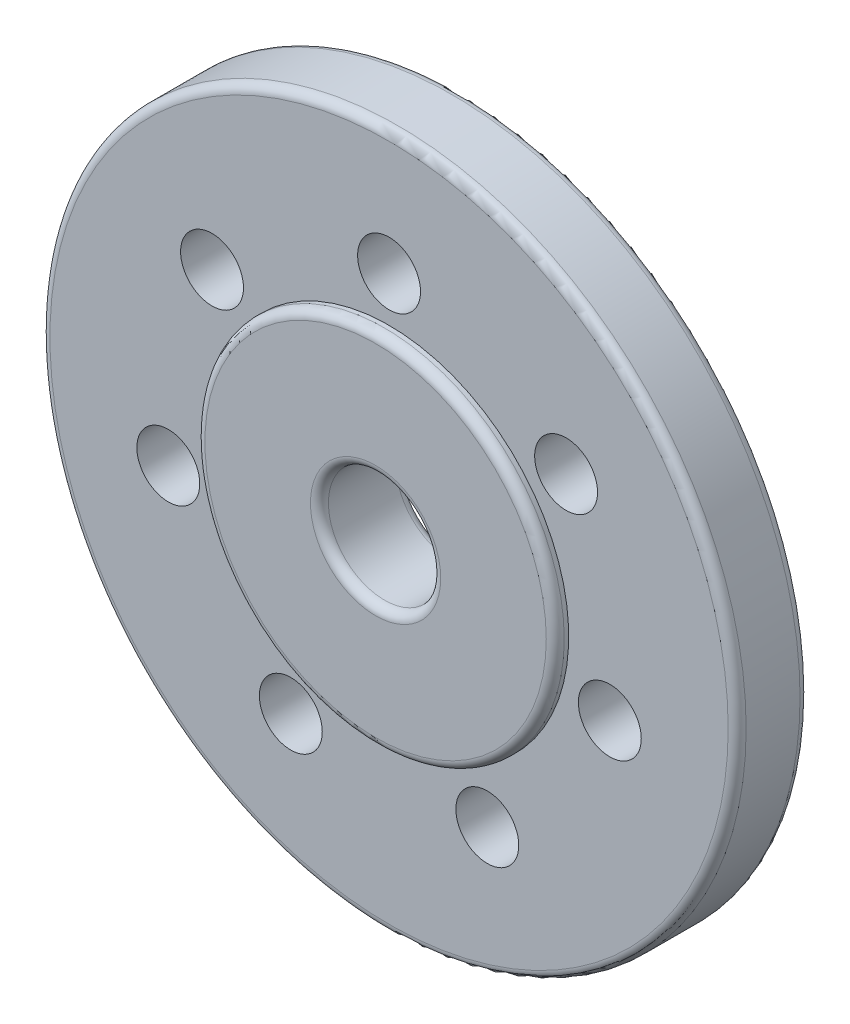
ISO-10303-21;
HEADER;
FILE_DESCRIPTION(('STEP AP214'),'2;1');
FILE_NAME('part.step','',(''),(''),'','','');
FILE_SCHEMA(('AUTOMOTIVE_DESIGN { 1 0 10303 214 1 1 1 1 }'));
ENDSEC;
DATA;
#1=APPLICATION_CONTEXT('core data for automotive mechanical design processes');
#2=APPLICATION_PROTOCOL_DEFINITION('international standard','automotive_design',2000,#1);
#3=PRODUCT_CONTEXT('',#1,'mechanical');
#4=PRODUCT('Part','Part','',(#3));
#5=PRODUCT_RELATED_PRODUCT_CATEGORY('part','',(#4));
#6=PRODUCT_DEFINITION_FORMATION('','',#4);
#7=PRODUCT_DEFINITION_CONTEXT('part definition',#1,'design');
#8=PRODUCT_DEFINITION('design','',#6,#7);
#9=PRODUCT_DEFINITION_SHAPE('','',#8);
#10=(LENGTH_UNIT() NAMED_UNIT(*) SI_UNIT(.MILLI.,.METRE.));
#11=(NAMED_UNIT(*) PLANE_ANGLE_UNIT() SI_UNIT($,.RADIAN.));
#12=(NAMED_UNIT(*) SI_UNIT($,.STERADIAN.) SOLID_ANGLE_UNIT());
#13=UNCERTAINTY_MEASURE_WITH_UNIT(LENGTH_MEASURE(1.E-05),#10,'distance_accuracy_value','');
#14=(GEOMETRIC_REPRESENTATION_CONTEXT(3) GLOBAL_UNCERTAINTY_ASSIGNED_CONTEXT((#13)) GLOBAL_UNIT_ASSIGNED_CONTEXT((#10,
#11,#12)) REPRESENTATION_CONTEXT('',''));
#15=CARTESIAN_POINT('',(0.,0.,0.));
#16=DIRECTION('',(0.,0.,1.));
#17=DIRECTION('',(1.,0.,0.));
#18=AXIS2_PLACEMENT_3D('',#15,#16,#17);
#19=CARTESIAN_POINT('',(0.,0.,20.32));
#20=DIRECTION('',(0.,0.,1.));
#21=DIRECTION('',(1.,0.,0.));
#22=AXIS2_PLACEMENT_3D('',#19,#20,#21);
#23=PLANE('',#22);
#24=CARTESIAN_POINT('',(0.,63.5,20.32));
#25=DIRECTION('',(0.,0.,1.));
#26=DIRECTION('',(1.,0.,0.));
#27=AXIS2_PLACEMENT_3D('',#24,#25,#26);
#28=CIRCLE('',#27,8.89);
#29=CARTESIAN_POINT('',(8.89,63.5,20.32));
#30=VERTEX_POINT('',#29);
#31=EDGE_CURVE('E94',#30,#30,#28,.T.);
#32=ORIENTED_EDGE('',*,*,#31,.F.);
#33=EDGE_LOOP('',(#32));
#34=FACE_BOUND('',#33,.T.);
#35=CARTESIAN_POINT('',(-50.0546534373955,39.3949493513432,20.32));
#36=DIRECTION('',(0.,0.,1.));
#37=DIRECTION('',(0.623489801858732,0.781831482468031,0.));
#38=AXIS2_PLACEMENT_3D('',#35,#36,#37);
#39=CIRCLE('',#38,8.89);
#40=CARTESIAN_POINT('',(-44.5118290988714,46.345431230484,20.32));
#41=VERTEX_POINT('',#40);
#42=EDGE_CURVE('E115',#41,#41,#39,.T.);
#43=ORIENTED_EDGE('',*,*,#42,.F.);
#44=EDGE_LOOP('',(#43));
#45=FACE_BOUND('',#44,.T.);
#46=CARTESIAN_POINT('',(-62.4171319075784,-14.7686078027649,20.32));
#47=DIRECTION('',(0.,0.,1.));
#48=DIRECTION('',(-0.222520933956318,0.974927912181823,0.));
#49=AXIS2_PLACEMENT_3D('',#46,#47,#48);
#50=CIRCLE('',#49,8.89);
#51=CARTESIAN_POINT('',(-64.3953430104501,-6.1014986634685,20.32));
#52=VERTEX_POINT('',#51);
#53=EDGE_CURVE('E125',#52,#52,#50,.T.);
#54=ORIENTED_EDGE('',*,*,#53,.F.);
#55=EDGE_LOOP('',(#54));
#56=FACE_BOUND('',#55,.T.);
#57=CARTESIAN_POINT('',(-27.7782369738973,-58.2044081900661,20.32));
#58=DIRECTION('',(0.,0.,1.));
#59=DIRECTION('',(-0.900968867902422,0.433883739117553,0.));
#60=AXIS2_PLACEMENT_3D('',#57,#58,#59);
#61=CIRCLE('',#60,8.89);
#62=CARTESIAN_POINT('',(-35.7878502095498,-54.3471817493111,20.32));
#63=VERTEX_POINT('',#62);
#64=EDGE_CURVE('E139',#63,#63,#61,.T.);
#65=ORIENTED_EDGE('',*,*,#64,.F.);
#66=EDGE_LOOP('',(#65));
#67=FACE_BOUND('',#66,.T.);
#68=CARTESIAN_POINT('',(27.7782369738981,-58.2044081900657,20.32));
#69=DIRECTION('',(0.,0.,1.));
#70=DIRECTION('',(-0.900968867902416,-0.433883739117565,0.));
#71=AXIS2_PLACEMENT_3D('',#68,#69,#70);
#72=CIRCLE('',#71,8.89);
#73=CARTESIAN_POINT('',(19.7686237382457,-62.0616346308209,20.32));
#74=VERTEX_POINT('',#73);
#75=EDGE_CURVE('E135',#74,#74,#72,.T.);
#76=ORIENTED_EDGE('',*,*,#75,.F.);
#77=EDGE_LOOP('',(#76));
#78=FACE_BOUND('',#77,.T.);
#79=CARTESIAN_POINT('',(62.4171319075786,-14.768607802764,20.32));
#80=DIRECTION('',(0.,0.,1.));
#81=DIRECTION('',(-0.222520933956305,-0.974927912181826,0.));
#82=AXIS2_PLACEMENT_3D('',#79,#80,#81);
#83=CIRCLE('',#82,8.89);
#84=CARTESIAN_POINT('',(60.4389208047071,-23.4357169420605,20.32));
#85=VERTEX_POINT('',#84);
#86=EDGE_CURVE('E130',#85,#85,#83,.T.);
#87=ORIENTED_EDGE('',*,*,#86,.F.);
#88=EDGE_LOOP('',(#87));
#89=FACE_BOUND('',#88,.T.);
#90=CARTESIAN_POINT('',(50.0546534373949,39.394949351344,20.32));
#91=DIRECTION('',(0.,0.,1.));
#92=DIRECTION('',(0.623489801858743,-0.781831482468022,0.));
#93=AXIS2_PLACEMENT_3D('',#90,#91,#92);
#94=CIRCLE('',#93,8.89);
#95=CARTESIAN_POINT('',(55.5974777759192,32.4444674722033,20.32));
#96=VERTEX_POINT('',#95);
#97=EDGE_CURVE('E126',#96,#96,#94,.T.);
#98=ORIENTED_EDGE('',*,*,#97,.F.);
#99=EDGE_LOOP('',(#98));
#100=FACE_BOUND('',#99,.T.);
#101=CARTESIAN_POINT('',(0.,0.,20.32));
#102=DIRECTION('',(0.,0.,1.));
#103=DIRECTION('',(1.,0.,0.));
#104=AXIS2_PLACEMENT_3D('',#101,#102,#103);
#105=CIRCLE('',#104,95.885);
#106=CARTESIAN_POINT('',(95.885,0.,20.32));
#107=VERTEX_POINT('',#106);
#108=EDGE_CURVE('E73',#107,#107,#105,.T.);
#109=ORIENTED_EDGE('',*,*,#108,.T.);
#110=EDGE_LOOP('',(#109));
#111=FACE_BOUND('',#110,.T.);
#112=CARTESIAN_POINT('',(0.,0.,20.32));
#113=DIRECTION('',(0.,0.,1.));
#114=DIRECTION('',(1.,0.,0.));
#115=AXIS2_PLACEMENT_3D('',#112,#113,#114);
#116=CIRCLE('',#115,50.8);
#117=CARTESIAN_POINT('',(-50.8,0.,20.32));
#118=VERTEX_POINT('',#117);
#119=EDGE_CURVE('E131',#118,#118,#116,.T.);
#120=ORIENTED_EDGE('',*,*,#119,.F.);
#121=EDGE_LOOP('',(#120));
#122=FACE_BOUND('',#121,.T.);
#123=ADVANCED_FACE('F41',(#34,#45,#56,#67,#78,#89,#100,#111,#122),#23,.T.);
#124=CARTESIAN_POINT('',(0.,0.,20.32));
#125=DIRECTION('',(0.,0.,-1.));
#126=DIRECTION('',(-1.,0.,0.));
#127=AXIS2_PLACEMENT_3D('',#124,#125,#126);
#128=CYLINDRICAL_SURFACE('',#127,98.425);
#129=CARTESIAN_POINT('',(0.,0.,2.54));
#130=DIRECTION('',(0.,0.,1.));
#131=DIRECTION('',(1.,0.,0.));
#132=AXIS2_PLACEMENT_3D('',#129,#130,#131);
#133=CIRCLE('',#132,98.425);
#134=CARTESIAN_POINT('',(98.425,0.,2.54));
#135=VERTEX_POINT('',#134);
#136=EDGE_CURVE('E81',#135,#135,#133,.T.);
#137=ORIENTED_EDGE('',*,*,#136,.T.);
#138=EDGE_LOOP('',(#137));
#139=FACE_BOUND('',#138,.T.);
#140=CARTESIAN_POINT('',(0.,0.,17.78));
#141=DIRECTION('',(0.,0.,1.));
#142=DIRECTION('',(1.,0.,0.));
#143=AXIS2_PLACEMENT_3D('',#140,#141,#142);
#144=CIRCLE('',#143,98.425);
#145=CARTESIAN_POINT('',(98.425,0.,17.78));
#146=VERTEX_POINT('',#145);
#147=EDGE_CURVE('E85',#146,#146,#144,.F.);
#148=ORIENTED_EDGE('',*,*,#147,.T.);
#149=EDGE_LOOP('',(#148));
#150=FACE_BOUND('',#149,.T.);
#151=ADVANCED_FACE('F153',(#139,#150),#128,.T.);
#152=CARTESIAN_POINT('',(0.,0.,0.));
#153=DIRECTION('',(0.,0.,1.));
#154=DIRECTION('',(1.,0.,0.));
#155=AXIS2_PLACEMENT_3D('',#152,#153,#154);
#156=PLANE('',#155);
#157=CARTESIAN_POINT('',(0.,0.,0.));
#158=DIRECTION('',(0.,0.,1.));
#159=DIRECTION('',(1.,0.,0.));
#160=AXIS2_PLACEMENT_3D('',#157,#158,#159);
#161=CIRCLE('',#160,18.415);
#162=CARTESIAN_POINT('',(18.415,0.,0.));
#163=VERTEX_POINT('',#162);
#164=EDGE_CURVE('E69',#163,#163,#161,.T.);
#165=ORIENTED_EDGE('',*,*,#164,.T.);
#166=EDGE_LOOP('',(#165));
#167=FACE_BOUND('',#166,.T.);
#168=CARTESIAN_POINT('',(0.,0.,0.));
#169=DIRECTION('',(0.,0.,1.));
#170=DIRECTION('',(1.,0.,0.));
#171=AXIS2_PLACEMENT_3D('',#168,#169,#170);
#172=CIRCLE('',#171,95.885);
#173=CARTESIAN_POINT('',(95.885,0.,0.));
#174=VERTEX_POINT('',#173);
#175=EDGE_CURVE('E77',#174,#174,#172,.F.);
#176=ORIENTED_EDGE('',*,*,#175,.T.);
#177=EDGE_LOOP('',(#176));
#178=FACE_BOUND('',#177,.T.);
#179=CARTESIAN_POINT('',(50.0546534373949,39.394949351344,0.));
#180=DIRECTION('',(0.,0.,1.));
#181=DIRECTION('',(1.,0.,0.));
#182=AXIS2_PLACEMENT_3D('',#179,#180,#181);
#183=CIRCLE('',#182,8.89);
#184=CARTESIAN_POINT('',(58.9446534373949,39.394949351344,0.));
#185=VERTEX_POINT('',#184);
#186=EDGE_CURVE('E90',#185,#185,#183,.T.);
#187=ORIENTED_EDGE('',*,*,#186,.T.);
#188=EDGE_LOOP('',(#187));
#189=FACE_BOUND('',#188,.T.);
#190=CARTESIAN_POINT('',(62.4171319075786,-14.768607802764,0.));
#191=DIRECTION('',(0.,0.,1.));
#192=DIRECTION('',(1.,0.,0.));
#193=AXIS2_PLACEMENT_3D('',#190,#191,#192);
#194=CIRCLE('',#193,8.89);
#195=CARTESIAN_POINT('',(71.3071319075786,-14.768607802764,0.));
#196=VERTEX_POINT('',#195);
#197=EDGE_CURVE('E95',#196,#196,#194,.T.);
#198=ORIENTED_EDGE('',*,*,#197,.T.);
#199=EDGE_LOOP('',(#198));
#200=FACE_BOUND('',#199,.T.);
#201=CARTESIAN_POINT('',(27.7782369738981,-58.2044081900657,0.));
#202=DIRECTION('',(0.,0.,1.));
#203=DIRECTION('',(1.,0.,0.));
#204=AXIS2_PLACEMENT_3D('',#201,#202,#203);
#205=CIRCLE('',#204,8.89);
#206=CARTESIAN_POINT('',(36.6682369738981,-58.2044081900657,0.));
#207=VERTEX_POINT('',#206);
#208=EDGE_CURVE('E99',#207,#207,#205,.T.);
#209=ORIENTED_EDGE('',*,*,#208,.T.);
#210=EDGE_LOOP('',(#209));
#211=FACE_BOUND('',#210,.T.);
#212=CARTESIAN_POINT('',(-27.7782369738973,-58.2044081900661,0.));
#213=DIRECTION('',(0.,0.,1.));
#214=DIRECTION('',(1.,0.,0.));
#215=AXIS2_PLACEMENT_3D('',#212,#213,#214);
#216=CIRCLE('',#215,8.89);
#217=CARTESIAN_POINT('',(-18.8882369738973,-58.2044081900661,0.));
#218=VERTEX_POINT('',#217);
#219=EDGE_CURVE('E103',#218,#218,#216,.T.);
#220=ORIENTED_EDGE('',*,*,#219,.T.);
#221=EDGE_LOOP('',(#220));
#222=FACE_BOUND('',#221,.T.);
#223=CARTESIAN_POINT('',(-62.4171319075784,-14.7686078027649,0.));
#224=DIRECTION('',(0.,0.,1.));
#225=DIRECTION('',(1.,0.,0.));
#226=AXIS2_PLACEMENT_3D('',#223,#224,#225);
#227=CIRCLE('',#226,8.89);
#228=CARTESIAN_POINT('',(-53.5271319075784,-14.7686078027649,0.));
#229=VERTEX_POINT('',#228);
#230=EDGE_CURVE('E107',#229,#229,#227,.T.);
#231=ORIENTED_EDGE('',*,*,#230,.T.);
#232=EDGE_LOOP('',(#231));
#233=FACE_BOUND('',#232,.T.);
#234=CARTESIAN_POINT('',(-50.0546534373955,39.3949493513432,0.));
#235=DIRECTION('',(0.,0.,1.));
#236=DIRECTION('',(1.,0.,0.));
#237=AXIS2_PLACEMENT_3D('',#234,#235,#236);
#238=CIRCLE('',#237,8.89);
#239=CARTESIAN_POINT('',(-41.1646534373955,39.3949493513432,0.));
#240=VERTEX_POINT('',#239);
#241=EDGE_CURVE('E111',#240,#240,#238,.T.);
#242=ORIENTED_EDGE('',*,*,#241,.T.);
#243=EDGE_LOOP('',(#242));
#244=FACE_BOUND('',#243,.T.);
#245=CARTESIAN_POINT('',(0.,63.5,0.));
#246=DIRECTION('',(0.,0.,1.));
#247=DIRECTION('',(1.,0.,0.));
#248=AXIS2_PLACEMENT_3D('',#245,#246,#247);
#249=CIRCLE('',#248,8.89);
#250=CARTESIAN_POINT('',(8.89,63.5,0.));
#251=VERTEX_POINT('',#250);
#252=EDGE_CURVE('E89',#251,#251,#249,.T.);
#253=ORIENTED_EDGE('',*,*,#252,.T.);
#254=EDGE_LOOP('',(#253));
#255=FACE_BOUND('',#254,.T.);
#256=ADVANCED_FACE('F159',(#167,#178,#189,#200,#211,#222,#233,#244,#255),#156,.F.);
#257=CARTESIAN_POINT('',(0.,63.5,-6.35));
#258=DIRECTION('',(0.,0.,1.));
#259=DIRECTION('',(1.,0.,0.));
#260=AXIS2_PLACEMENT_3D('',#257,#258,#259);
#261=CYLINDRICAL_SURFACE('',#260,8.89);
#262=ORIENTED_EDGE('',*,*,#31,.T.);
#263=EDGE_LOOP('',(#262));
#264=FACE_BOUND('',#263,.T.);
#265=ORIENTED_EDGE('',*,*,#252,.F.);
#266=EDGE_LOOP('',(#265));
#267=FACE_BOUND('',#266,.T.);
#268=ADVANCED_FACE('F166',(#264,#267),#261,.F.);
#269=CARTESIAN_POINT('',(-50.0546534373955,39.3949493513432,-6.35));
#270=DIRECTION('',(0.,0.,1.));
#271=DIRECTION('',(1.,0.,0.));
#272=AXIS2_PLACEMENT_3D('',#269,#270,#271);
#273=CYLINDRICAL_SURFACE('',#272,8.89);
#274=ORIENTED_EDGE('',*,*,#42,.T.);
#275=EDGE_LOOP('',(#274));
#276=FACE_BOUND('',#275,.T.);
#277=ORIENTED_EDGE('',*,*,#241,.F.);
#278=EDGE_LOOP('',(#277));
#279=FACE_BOUND('',#278,.T.);
#280=ADVANCED_FACE('F212',(#276,#279),#273,.F.);
#281=CARTESIAN_POINT('',(-62.4171319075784,-14.7686078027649,-6.35));
#282=DIRECTION('',(0.,0.,1.));
#283=DIRECTION('',(1.,0.,0.));
#284=AXIS2_PLACEMENT_3D('',#281,#282,#283);
#285=CYLINDRICAL_SURFACE('',#284,8.89);
#286=ORIENTED_EDGE('',*,*,#53,.T.);
#287=EDGE_LOOP('',(#286));
#288=FACE_BOUND('',#287,.T.);
#289=ORIENTED_EDGE('',*,*,#230,.F.);
#290=EDGE_LOOP('',(#289));
#291=FACE_BOUND('',#290,.T.);
#292=ADVANCED_FACE('F208',(#288,#291),#285,.F.);
#293=CARTESIAN_POINT('',(-27.7782369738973,-58.2044081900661,-6.35));
#294=DIRECTION('',(0.,0.,1.));
#295=DIRECTION('',(1.,0.,0.));
#296=AXIS2_PLACEMENT_3D('',#293,#294,#295);
#297=CYLINDRICAL_SURFACE('',#296,8.89);
#298=ORIENTED_EDGE('',*,*,#64,.T.);
#299=EDGE_LOOP('',(#298));
#300=FACE_BOUND('',#299,.T.);
#301=ORIENTED_EDGE('',*,*,#219,.F.);
#302=EDGE_LOOP('',(#301));
#303=FACE_BOUND('',#302,.T.);
#304=ADVANCED_FACE('F211',(#300,#303),#297,.F.);
#305=CARTESIAN_POINT('',(27.7782369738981,-58.2044081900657,-6.35));
#306=DIRECTION('',(0.,0.,1.));
#307=DIRECTION('',(1.,0.,0.));
#308=AXIS2_PLACEMENT_3D('',#305,#306,#307);
#309=CYLINDRICAL_SURFACE('',#308,8.89);
#310=ORIENTED_EDGE('',*,*,#75,.T.);
#311=EDGE_LOOP('',(#310));
#312=FACE_BOUND('',#311,.T.);
#313=ORIENTED_EDGE('',*,*,#208,.F.);
#314=EDGE_LOOP('',(#313));
#315=FACE_BOUND('',#314,.T.);
#316=ADVANCED_FACE('F216',(#312,#315),#309,.F.);
#317=CARTESIAN_POINT('',(62.4171319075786,-14.768607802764,-6.35));
#318=DIRECTION('',(0.,0.,1.));
#319=DIRECTION('',(1.,0.,0.));
#320=AXIS2_PLACEMENT_3D('',#317,#318,#319);
#321=CYLINDRICAL_SURFACE('',#320,8.89);
#322=ORIENTED_EDGE('',*,*,#86,.T.);
#323=EDGE_LOOP('',(#322));
#324=FACE_BOUND('',#323,.T.);
#325=ORIENTED_EDGE('',*,*,#197,.F.);
#326=EDGE_LOOP('',(#325));
#327=FACE_BOUND('',#326,.T.);
#328=ADVANCED_FACE('F220',(#324,#327),#321,.F.);
#329=CARTESIAN_POINT('',(50.0546534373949,39.394949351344,-6.35));
#330=DIRECTION('',(0.,0.,1.));
#331=DIRECTION('',(1.,0.,0.));
#332=AXIS2_PLACEMENT_3D('',#329,#330,#331);
#333=CYLINDRICAL_SURFACE('',#332,8.89);
#334=ORIENTED_EDGE('',*,*,#97,.T.);
#335=EDGE_LOOP('',(#334));
#336=FACE_BOUND('',#335,.T.);
#337=ORIENTED_EDGE('',*,*,#186,.F.);
#338=EDGE_LOOP('',(#337));
#339=FACE_BOUND('',#338,.T.);
#340=ADVANCED_FACE('F175',(#336,#339),#333,.F.);
#341=CARTESIAN_POINT('',(0.,0.,2.54));
#342=DIRECTION('',(0.,0.,1.));
#343=DIRECTION('',(1.,0.,0.));
#344=AXIS2_PLACEMENT_3D('',#341,#342,#343);
#345=TOROIDAL_SURFACE('',#344,95.885,2.54);
#346=ORIENTED_EDGE('',*,*,#175,.F.);
#347=EDGE_LOOP('',(#346));
#348=FACE_BOUND('',#347,.T.);
#349=ORIENTED_EDGE('',*,*,#136,.F.);
#350=EDGE_LOOP('',(#349));
#351=FACE_BOUND('',#350,.T.);
#352=ADVANCED_FACE('F171',(#348,#351),#345,.T.);
#353=CARTESIAN_POINT('',(0.,0.,17.78));
#354=DIRECTION('',(0.,0.,1.));
#355=DIRECTION('',(1.,0.,0.));
#356=AXIS2_PLACEMENT_3D('',#353,#354,#355);
#357=TOROIDAL_SURFACE('',#356,95.885,2.54);
#358=ORIENTED_EDGE('',*,*,#147,.F.);
#359=EDGE_LOOP('',(#358));
#360=FACE_BOUND('',#359,.T.);
#361=ORIENTED_EDGE('',*,*,#108,.F.);
#362=EDGE_LOOP('',(#361));
#363=FACE_BOUND('',#362,.T.);
#364=ADVANCED_FACE('F174',(#360,#363),#357,.T.);
#365=CARTESIAN_POINT('',(0.,0.,0.));
#366=DIRECTION('',(0.,0.,1.));
#367=DIRECTION('',(1.,0.,0.));
#368=AXIS2_PLACEMENT_3D('',#365,#366,#367);
#369=CYLINDRICAL_SURFACE('',#368,15.875);
#370=CARTESIAN_POINT('',(0.,0.,2.54));
#371=DIRECTION('',(0.,0.,1.));
#372=DIRECTION('',(1.,0.,0.));
#373=AXIS2_PLACEMENT_3D('',#370,#371,#372);
#374=CIRCLE('',#373,15.875);
#375=CARTESIAN_POINT('',(15.875,0.,2.54));
#376=VERTEX_POINT('',#375);
#377=EDGE_CURVE('E59',#376,#376,#374,.F.);
#378=ORIENTED_EDGE('',*,*,#377,.T.);
#379=EDGE_LOOP('',(#378));
#380=FACE_BOUND('',#379,.T.);
#381=CARTESIAN_POINT('',(0.,0.,21.59));
#382=DIRECTION('',(0.,0.,1.));
#383=DIRECTION('',(1.,0.,0.));
#384=AXIS2_PLACEMENT_3D('',#381,#382,#383);
#385=CIRCLE('',#384,15.875);
#386=CARTESIAN_POINT('',(15.875,0.,21.59));
#387=VERTEX_POINT('',#386);
#388=EDGE_CURVE('E65',#387,#387,#385,.T.);
#389=ORIENTED_EDGE('',*,*,#388,.T.);
#390=EDGE_LOOP('',(#389));
#391=FACE_BOUND('',#390,.T.);
#392=ADVANCED_FACE('F179',(#380,#391),#369,.F.);
#393=CARTESIAN_POINT('',(0.,0.,24.13));
#394=DIRECTION('',(0.,0.,1.));
#395=DIRECTION('',(1.,0.,0.));
#396=AXIS2_PLACEMENT_3D('',#393,#394,#395);
#397=PLANE('',#396);
#398=CARTESIAN_POINT('',(0.,0.,24.13));
#399=DIRECTION('',(0.,0.,1.));
#400=DIRECTION('',(1.,0.,0.));
#401=AXIS2_PLACEMENT_3D('',#398,#399,#400);
#402=CIRCLE('',#401,48.26);
#403=CARTESIAN_POINT('',(48.26,0.,24.13));
#404=VERTEX_POINT('',#403);
#405=EDGE_CURVE('E49',#404,#404,#402,.T.);
#406=ORIENTED_EDGE('',*,*,#405,.T.);
#407=EDGE_LOOP('',(#406));
#408=FACE_BOUND('',#407,.T.);
#409=CARTESIAN_POINT('',(0.,0.,24.13));
#410=DIRECTION('',(0.,0.,1.));
#411=DIRECTION('',(1.,0.,0.));
#412=AXIS2_PLACEMENT_3D('',#409,#410,#411);
#413=CIRCLE('',#412,18.415);
#414=CARTESIAN_POINT('',(18.415,0.,24.13));
#415=VERTEX_POINT('',#414);
#416=EDGE_CURVE('E54',#415,#415,#413,.F.);
#417=ORIENTED_EDGE('',*,*,#416,.T.);
#418=EDGE_LOOP('',(#417));
#419=FACE_BOUND('',#418,.T.);
#420=ADVANCED_FACE('F199',(#408,#419),#397,.T.);
#421=CARTESIAN_POINT('',(0.,0.,24.13));
#422=DIRECTION('',(0.,0.,-1.));
#423=DIRECTION('',(-1.,0.,0.));
#424=AXIS2_PLACEMENT_3D('',#421,#422,#423);
#425=CYLINDRICAL_SURFACE('',#424,50.8);
#426=CARTESIAN_POINT('',(0.,0.,21.59));
#427=DIRECTION('',(0.,0.,1.));
#428=DIRECTION('',(1.,0.,0.));
#429=AXIS2_PLACEMENT_3D('',#426,#427,#428);
#430=CIRCLE('',#429,50.8);
#431=CARTESIAN_POINT('',(-50.8,0.,21.59));
#432=VERTEX_POINT('',#431);
#433=EDGE_CURVE('E10',#432,#432,#430,.F.);
#434=CARTESIAN_POINT('',(-50.8,0.,21.59));
#435=CARTESIAN_POINT('',(-50.8,0.,21.5767708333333));
#436=CARTESIAN_POINT('',(-50.8,0.,21.5635416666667));
#437=CARTESIAN_POINT('',(-50.8,0.,21.5370833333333));
#438=CARTESIAN_POINT('',(-50.8,0.,21.5238541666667));
#439=CARTESIAN_POINT('',(-50.8,0.,21.4973958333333));
#440=CARTESIAN_POINT('',(-50.8,0.,21.4841666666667));
#441=CARTESIAN_POINT('',(-50.8,0.,21.4577083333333));
#442=CARTESIAN_POINT('',(-50.8,0.,21.4444791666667));
#443=CARTESIAN_POINT('',(-50.8,0.,21.4180208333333));
#444=CARTESIAN_POINT('',(-50.8,0.,21.4047916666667));
#445=CARTESIAN_POINT('',(-50.8,0.,21.3783333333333));
#446=CARTESIAN_POINT('',(-50.8,0.,21.3651041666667));
#447=CARTESIAN_POINT('',(-50.8,0.,21.3386458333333));
#448=CARTESIAN_POINT('',(-50.8,0.,21.3254166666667));
#449=CARTESIAN_POINT('',(-50.8,0.,21.2989583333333));
#450=CARTESIAN_POINT('',(-50.8,0.,21.2857291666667));
#451=CARTESIAN_POINT('',(-50.8,0.,21.2592708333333));
#452=CARTESIAN_POINT('',(-50.8,0.,21.2460416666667));
#453=CARTESIAN_POINT('',(-50.8,0.,21.2195833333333));
#454=CARTESIAN_POINT('',(-50.8,0.,21.2063541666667));
#455=CARTESIAN_POINT('',(-50.8,0.,21.1798958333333));
#456=CARTESIAN_POINT('',(-50.8,0.,21.1666666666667));
#457=CARTESIAN_POINT('',(-50.8,0.,21.1402083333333));
#458=CARTESIAN_POINT('',(-50.8,0.,21.1269791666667));
#459=CARTESIAN_POINT('',(-50.8,0.,21.1005208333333));
#460=CARTESIAN_POINT('',(-50.8,0.,21.0872916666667));
#461=CARTESIAN_POINT('',(-50.8,0.,21.0608333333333));
#462=CARTESIAN_POINT('',(-50.8,0.,21.0476041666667));
#463=CARTESIAN_POINT('',(-50.8,0.,21.0211458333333));
#464=CARTESIAN_POINT('',(-50.8,0.,21.0079166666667));
#465=CARTESIAN_POINT('',(-50.8,0.,20.9814583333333));
#466=CARTESIAN_POINT('',(-50.8,0.,20.9682291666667));
#467=CARTESIAN_POINT('',(-50.8,0.,20.9417708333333));
#468=CARTESIAN_POINT('',(-50.8,0.,20.9285416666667));
#469=CARTESIAN_POINT('',(-50.8,0.,20.9020833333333));
#470=CARTESIAN_POINT('',(-50.8,0.,20.8888541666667));
#471=CARTESIAN_POINT('',(-50.8,0.,20.8623958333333));
#472=CARTESIAN_POINT('',(-50.8,0.,20.8491666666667));
#473=CARTESIAN_POINT('',(-50.8,0.,20.8227083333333));
#474=CARTESIAN_POINT('',(-50.8,0.,20.8094791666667));
#475=CARTESIAN_POINT('',(-50.8,0.,20.7830208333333));
#476=CARTESIAN_POINT('',(-50.8,0.,20.7697916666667));
#477=CARTESIAN_POINT('',(-50.8,0.,20.7433333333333));
#478=CARTESIAN_POINT('',(-50.8,0.,20.7301041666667));
#479=CARTESIAN_POINT('',(-50.8,0.,20.7036458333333));
#480=CARTESIAN_POINT('',(-50.8,0.,20.6904166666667));
#481=CARTESIAN_POINT('',(-50.8,0.,20.6639583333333));
#482=CARTESIAN_POINT('',(-50.8,0.,20.6507291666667));
#483=CARTESIAN_POINT('',(-50.8,0.,20.6242708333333));
#484=CARTESIAN_POINT('',(-50.8,0.,20.6110416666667));
#485=CARTESIAN_POINT('',(-50.8,0.,20.5845833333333));
#486=CARTESIAN_POINT('',(-50.8,0.,20.5713541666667));
#487=CARTESIAN_POINT('',(-50.8,0.,20.5448958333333));
#488=CARTESIAN_POINT('',(-50.8,0.,20.5316666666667));
#489=CARTESIAN_POINT('',(-50.8,0.,20.5052083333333));
#490=CARTESIAN_POINT('',(-50.8,0.,20.4919791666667));
#491=CARTESIAN_POINT('',(-50.8,0.,20.4655208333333));
#492=CARTESIAN_POINT('',(-50.8,0.,20.4522916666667));
#493=CARTESIAN_POINT('',(-50.8,0.,20.4258333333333));
#494=CARTESIAN_POINT('',(-50.8,0.,20.4126041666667));
#495=CARTESIAN_POINT('',(-50.8,0.,20.3861458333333));
#496=CARTESIAN_POINT('',(-50.8,0.,20.3729166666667));
#497=CARTESIAN_POINT('',(-50.8,0.,20.3464583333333));
#498=CARTESIAN_POINT('',(-50.8,0.,20.3332291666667));
#499=CARTESIAN_POINT('',(-50.8,0.,20.32));
#500=B_SPLINE_CURVE_WITH_KNOTS('',3,(#434,#435,#436,#437,#438,#439,#440,#441,#442,#443,#444,
#445,#446,#447,#448,#449,#450,#451,#452,#453,#454,#455,#456,#457,#458,#459,#460,#461,#462,#463,
#464,#465,#466,#467,#468,#469,#470,#471,#472,#473,#474,#475,#476,#477,#478,#479,#480,#481,#482,
#483,#484,#485,#486,#487,#488,#489,#490,#491,#492,#493,#494,#495,#496,#497,#498,#499),
.UNSPECIFIED.,.F.,.F.,(4,2,2,2,2,2,2,2,2,2,2,2,2,2,2,2,2,2,2,2,2,2,2,2,2,2,2,2,2,2,2,2,4),(0.,
0.0396874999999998,0.0793750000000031,0.119062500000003,0.158750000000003,0.198437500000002,
0.238125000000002,0.277812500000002,0.317500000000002,0.357187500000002,0.396875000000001,
0.436562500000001,0.476250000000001,0.515937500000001,0.555625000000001,0.5953125,0.635,
0.6746875,0.714375,0.754062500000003,0.793750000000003,0.833437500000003,0.873125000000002,
0.912812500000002,0.952500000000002,0.992187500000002,1.031875,1.0715625,1.11125,1.1509375,
1.190625,1.2303125,1.27),.UNSPECIFIED.);
#501=EDGE_CURVE('BSEAM150',#432,#118,#500,.T.);
#502=ORIENTED_EDGE('',*,*,#433,.T.);
#503=ORIENTED_EDGE('',*,*,#119,.T.);
#504=ORIENTED_EDGE('',*,*,#501,.T.);
#505=ORIENTED_EDGE('',*,*,#501,.F.);
#506=EDGE_LOOP('',(#502,#504,#503,#505));
#507=FACE_BOUND('',#506,.T.);
#508=ADVANCED_FACE('F150',(#507),#425,.T.);
#509=CARTESIAN_POINT('',(0.,0.,2.54));
#510=DIRECTION('',(0.,0.,1.));
#511=DIRECTION('',(1.,0.,0.));
#512=AXIS2_PLACEMENT_3D('',#509,#510,#511);
#513=TOROIDAL_SURFACE('',#512,18.415,2.54);
#514=ORIENTED_EDGE('',*,*,#377,.F.);
#515=EDGE_LOOP('',(#514));
#516=FACE_BOUND('',#515,.T.);
#517=ORIENTED_EDGE('',*,*,#164,.F.);
#518=EDGE_LOOP('',(#517));
#519=FACE_BOUND('',#518,.T.);
#520=ADVANCED_FACE('F181',(#516,#519),#513,.T.);
#521=CARTESIAN_POINT('',(0.,0.,21.59));
#522=DIRECTION('',(0.,0.,1.));
#523=DIRECTION('',(1.,0.,0.));
#524=AXIS2_PLACEMENT_3D('',#521,#522,#523);
#525=TOROIDAL_SURFACE('',#524,48.26,2.54);
#526=ORIENTED_EDGE('',*,*,#433,.F.);
#527=EDGE_LOOP('',(#526));
#528=FACE_BOUND('',#527,.T.);
#529=ORIENTED_EDGE('',*,*,#405,.F.);
#530=EDGE_LOOP('',(#529));
#531=FACE_BOUND('',#530,.T.);
#532=ADVANCED_FACE('F183',(#528,#531),#525,.T.);
#533=CARTESIAN_POINT('',(0.,0.,21.59));
#534=DIRECTION('',(0.,0.,1.));
#535=DIRECTION('',(1.,0.,0.));
#536=AXIS2_PLACEMENT_3D('',#533,#534,#535);
#537=TOROIDAL_SURFACE('',#536,18.415,2.54);
#538=ORIENTED_EDGE('',*,*,#416,.F.);
#539=EDGE_LOOP('',(#538));
#540=FACE_BOUND('',#539,.T.);
#541=ORIENTED_EDGE('',*,*,#388,.F.);
#542=EDGE_LOOP('',(#541));
#543=FACE_BOUND('',#542,.T.);
#544=ADVANCED_FACE('F43',(#540,#543),#537,.T.);
#545=CLOSED_SHELL('',(#123,#151,#256,#268,#280,#292,#304,#316,#328,#340,#352,#364,#392,#420,
#508,#520,#532,#544));
#546=MANIFOLD_SOLID_BREP('B2',#545);
#547=ADVANCED_BREP_SHAPE_REPRESENTATION('',(#18,#546),#14);
#548=SHAPE_DEFINITION_REPRESENTATION(#9,#547);
ENDSEC;
END-ISO-10303-21;
